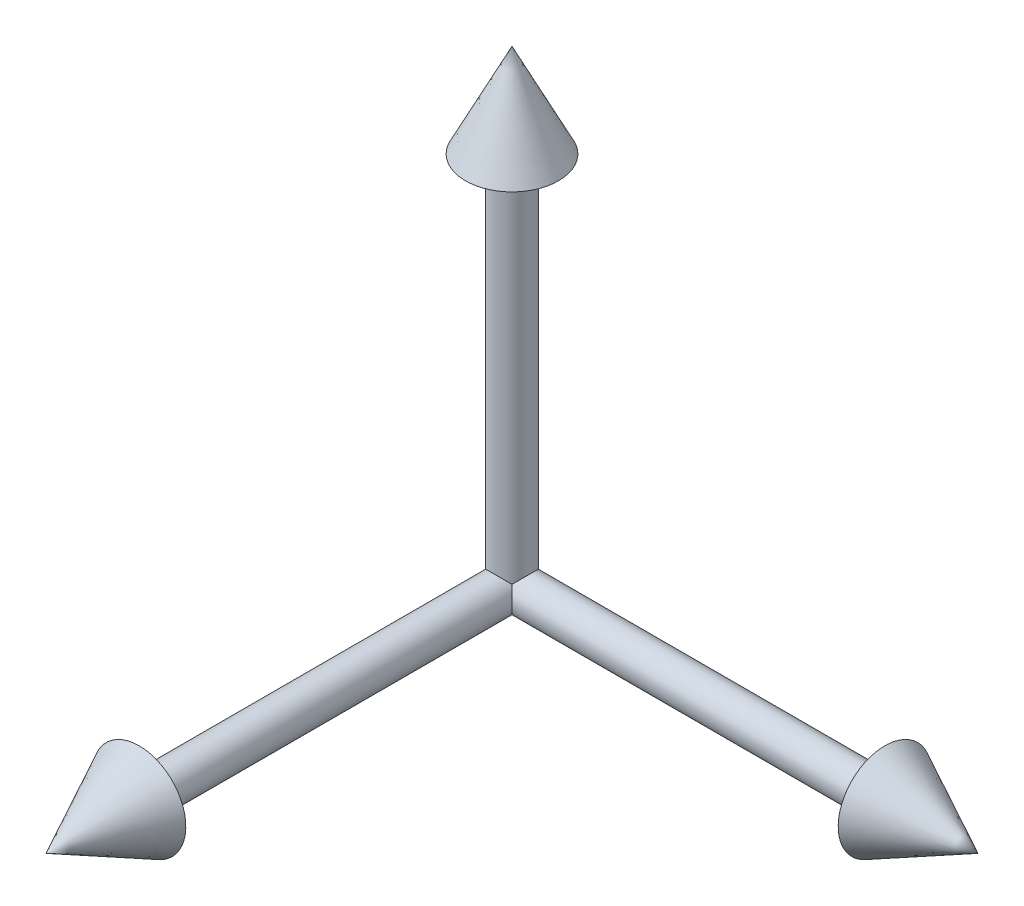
from build123d import *


with BuildPart() as part:
    # Esquisse1 → R_volution1 (revolve)
    with BuildSketch(Plane.XY, mode=Mode.PRIVATE) as r_volution1_sk:
        Polygon((200, 10), (200, 25), (250, 0), (140.310196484, 0), (0, 0), (0, 10), align=None)
    revolve(r_volution1_sk.sketch.rotate(Axis((0, 0, 0), (1, 0, 0)), 180), axis=Axis((0, 0, 0), (1, 0, 0)))

    # Esquisse2 → R_volution2 (revolve)
    with BuildSketch(Plane.XY):
        Polygon((0, 0), (10, 0), (10, 200), (25, 200), (0, 250), (0, 200), align=None)
    revolve(axis=Axis((0, 0, 0), (0, 1, 0)))

    # Esquisse3 → R_volution3 (revolve)
    with BuildSketch(Plane(origin=(0, 0, 0), x_dir=(0, 0, -1), z_dir=(1, 0, 0))):
        Polygon((-200, 10), (-200, 25), (-250, 0), (-200, 0), (0, 0), (0, 10), align=None)
    revolve(axis=Axis((0, 0, 0), (0, 0, 1)))


solid = part.part
